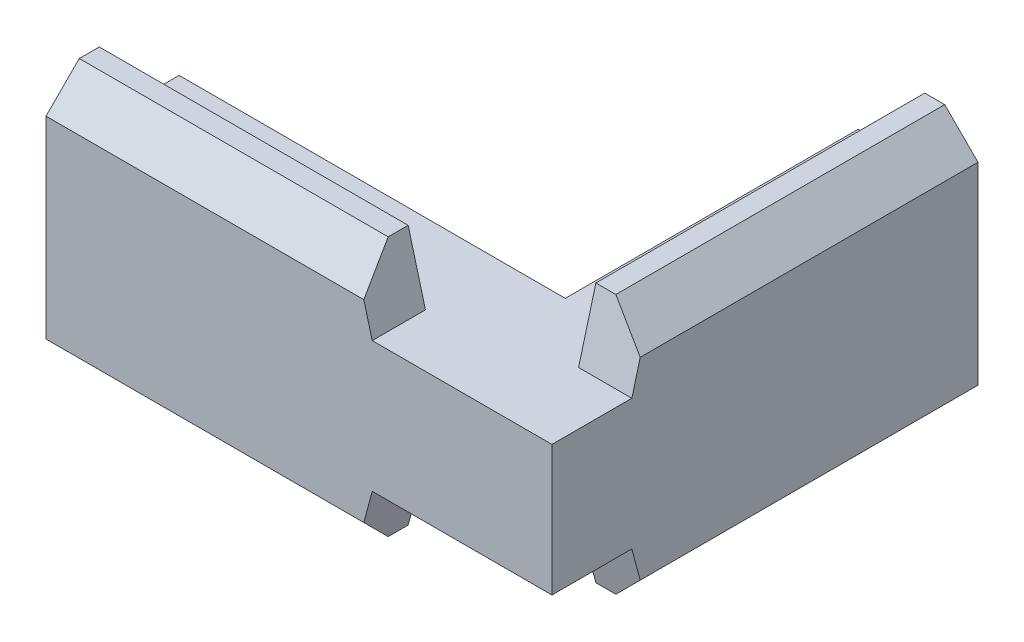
ISO-10303-21;
HEADER;
FILE_DESCRIPTION(('STEP AP214'),'2;1');
FILE_NAME('part.step','',(''),(''),'','','');
FILE_SCHEMA(('AUTOMOTIVE_DESIGN { 1 0 10303 214 1 1 1 1 }'));
ENDSEC;
DATA;
#1=APPLICATION_CONTEXT('core data for automotive mechanical design processes');
#2=APPLICATION_PROTOCOL_DEFINITION('international standard','automotive_design',2000,#1);
#3=PRODUCT_CONTEXT('',#1,'mechanical');
#4=PRODUCT('Part','Part','',(#3));
#5=PRODUCT_RELATED_PRODUCT_CATEGORY('part','',(#4));
#6=PRODUCT_DEFINITION_FORMATION('','',#4);
#7=PRODUCT_DEFINITION_CONTEXT('part definition',#1,'design');
#8=PRODUCT_DEFINITION('design','',#6,#7);
#9=PRODUCT_DEFINITION_SHAPE('','',#8);
#10=(LENGTH_UNIT() NAMED_UNIT(*) SI_UNIT(.MILLI.,.METRE.));
#11=(NAMED_UNIT(*) PLANE_ANGLE_UNIT() SI_UNIT($,.RADIAN.));
#12=(NAMED_UNIT(*) SI_UNIT($,.STERADIAN.) SOLID_ANGLE_UNIT());
#13=UNCERTAINTY_MEASURE_WITH_UNIT(LENGTH_MEASURE(1.E-05),#10,'distance_accuracy_value','');
#14=(GEOMETRIC_REPRESENTATION_CONTEXT(3) GLOBAL_UNCERTAINTY_ASSIGNED_CONTEXT((#13)) GLOBAL_UNIT_ASSIGNED_CONTEXT((#10,
#11,#12)) REPRESENTATION_CONTEXT('',''));
#15=CARTESIAN_POINT('',(0.,0.,0.));
#16=DIRECTION('',(0.,0.,1.));
#17=DIRECTION('',(1.,0.,0.));
#18=AXIS2_PLACEMENT_3D('',#15,#16,#17);
#19=CARTESIAN_POINT('',(10.,-9.75,2.700446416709));
#20=DIRECTION('',(0.,-1.,0.));
#21=DIRECTION('',(0.,0.,-1.));
#22=AXIS2_PLACEMENT_3D('',#19,#20,#21);
#23=PLANE('',#22);
#24=DIRECTION('',(0.,0.,-1.));
#25=VECTOR('',#24,1.);
#26=CARTESIAN_POINT('',(6.,-9.75,0.));
#27=LINE('',#26,#25);
#28=CARTESIAN_POINT('',(6.,-9.75000000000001,2.70044641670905));
#29=VERTEX_POINT('',#28);
#30=CARTESIAN_POINT('',(6.,-9.75,-22.));
#31=VERTEX_POINT('',#30);
#32=EDGE_CURVE('E181',#29,#31,#27,.T.);
#33=ORIENTED_EDGE('',*,*,#32,.T.);
#34=DIRECTION('',(1.,0.,0.));
#35=VECTOR('',#34,1.);
#36=CARTESIAN_POINT('',(10.,-9.75,-22.));
#37=LINE('',#36,#35);
#38=CARTESIAN_POINT('',(7.5,-9.75,-22.));
#39=VERTEX_POINT('',#38);
#40=EDGE_CURVE('E175',#31,#39,#37,.T.);
#41=ORIENTED_EDGE('',*,*,#40,.T.);
#42=DIRECTION('',(0.,0.,1.));
#43=VECTOR('',#42,1.);
#44=CARTESIAN_POINT('',(7.5,-9.75,-9.649776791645));
#45=LINE('',#44,#43);
#46=CARTESIAN_POINT('',(7.5,-9.75000000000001,2.70044641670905));
#47=VERTEX_POINT('',#46);
#48=EDGE_CURVE('E177',#47,#39,#45,.F.);
#49=ORIENTED_EDGE('',*,*,#48,.F.);
#50=DIRECTION('',(1.,0.,0.));
#51=VECTOR('',#50,1.);
#52=CARTESIAN_POINT('',(10.,-9.75,2.700446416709));
#53=LINE('',#52,#51);
#54=EDGE_CURVE('E19',#47,#29,#53,.F.);
#55=ORIENTED_EDGE('',*,*,#54,.T.);
#56=EDGE_LOOP('',(#33,#41,#49,#55));
#57=FACE_BOUND('',#56,.T.);
#58=ADVANCED_FACE('F16',(#57),#23,.T.);
#59=CARTESIAN_POINT('',(10.,9.75,-22.));
#60=DIRECTION('',(0.,1.,0.));
#61=DIRECTION('',(0.,0.,1.));
#62=AXIS2_PLACEMENT_3D('',#59,#60,#61);
#63=PLANE('',#62);
#64=DIRECTION('',(0.,0.,-1.));
#65=VECTOR('',#64,1.);
#66=CARTESIAN_POINT('',(6.,9.75,0.));
#67=LINE('',#66,#65);
#68=CARTESIAN_POINT('',(6.,9.75,-22.));
#69=VERTEX_POINT('',#68);
#70=CARTESIAN_POINT('',(6.,9.75,2.700446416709));
#71=VERTEX_POINT('',#70);
#72=EDGE_CURVE('E203',#69,#71,#67,.F.);
#73=ORIENTED_EDGE('',*,*,#72,.T.);
#74=DIRECTION('',(1.,0.,0.));
#75=VECTOR('',#74,1.);
#76=CARTESIAN_POINT('',(10.,9.75,2.700446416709));
#77=LINE('',#76,#75);
#78=CARTESIAN_POINT('',(7.5,9.75,2.70044641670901));
#79=VERTEX_POINT('',#78);
#80=EDGE_CURVE('E215',#79,#71,#77,.F.);
#81=ORIENTED_EDGE('',*,*,#80,.F.);
#82=DIRECTION('',(0.,0.,1.));
#83=VECTOR('',#82,1.);
#84=CARTESIAN_POINT('',(7.5,9.75,-9.649776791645));
#85=LINE('',#84,#83);
#86=CARTESIAN_POINT('',(7.5,9.75,-22.));
#87=VERTEX_POINT('',#86);
#88=EDGE_CURVE('E180',#87,#79,#85,.T.);
#89=ORIENTED_EDGE('',*,*,#88,.F.);
#90=DIRECTION('',(1.,0.,0.));
#91=VECTOR('',#90,1.);
#92=CARTESIAN_POINT('',(10.,9.75,-22.));
#93=LINE('',#92,#91);
#94=EDGE_CURVE('E197',#87,#69,#93,.F.);
#95=ORIENTED_EDGE('',*,*,#94,.T.);
#96=EDGE_LOOP('',(#73,#81,#89,#95));
#97=FACE_BOUND('',#96,.T.);
#98=ADVANCED_FACE('F201',(#97),#63,.T.);
#99=CARTESIAN_POINT('',(-28.,-9.75,10.));
#100=DIRECTION('',(0.,-1.,0.));
#101=DIRECTION('',(0.,0.,-1.));
#102=AXIS2_PLACEMENT_3D('',#99,#100,#101);
#103=PLANE('',#102);
#104=DIRECTION('',(1.,0.,0.));
#105=VECTOR('',#104,1.);
#106=CARTESIAN_POINT('',(1.,-9.75,6.));
#107=LINE('',#106,#105);
#108=CARTESIAN_POINT('',(-28.,-9.75,6.));
#109=VERTEX_POINT('',#108);
#110=CARTESIAN_POINT('',(-4.799553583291,-9.75,6.));
#111=VERTEX_POINT('',#110);
#112=EDGE_CURVE('E278',#109,#111,#107,.T.);
#113=ORIENTED_EDGE('',*,*,#112,.T.);
#114=DIRECTION('',(0.,0.,-1.));
#115=VECTOR('',#114,1.);
#116=CARTESIAN_POINT('',(-4.799553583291,-9.75,10.));
#117=LINE('',#116,#115);
#118=CARTESIAN_POINT('',(-4.799553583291,-9.75,7.5));
#119=VERTEX_POINT('',#118);
#120=EDGE_CURVE('E193',#111,#119,#117,.F.);
#121=ORIENTED_EDGE('',*,*,#120,.T.);
#122=DIRECTION('',(1.,0.,0.));
#123=VECTOR('',#122,1.);
#124=CARTESIAN_POINT('',(-16.39977679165,-9.75,7.5));
#125=LINE('',#124,#123);
#126=CARTESIAN_POINT('',(-28.,-9.75,7.5));
#127=VERTEX_POINT('',#126);
#128=EDGE_CURVE('E275',#127,#119,#125,.T.);
#129=ORIENTED_EDGE('',*,*,#128,.F.);
#130=DIRECTION('',(0.,0.,-1.));
#131=VECTOR('',#130,1.);
#132=CARTESIAN_POINT('',(-28.,-9.75,10.));
#133=LINE('',#132,#131);
#134=EDGE_CURVE('E195',#127,#109,#133,.T.);
#135=ORIENTED_EDGE('',*,*,#134,.T.);
#136=EDGE_LOOP('',(#113,#121,#129,#135));
#137=FACE_BOUND('',#136,.T.);
#138=ADVANCED_FACE('F406',(#137),#103,.T.);
#139=CARTESIAN_POINT('',(6.,-4.9,0.));
#140=DIRECTION('',(1.,0.,0.));
#141=DIRECTION('',(0.,0.,-1.));
#142=AXIS2_PLACEMENT_3D('',#139,#140,#141);
#143=PLANE('',#142);
#144=DIRECTION('',(0.,1.,0.));
#145=VECTOR('',#144,1.);
#146=CARTESIAN_POINT('',(6.,-4.9,-22.));
#147=LINE('',#146,#145);
#148=CARTESIAN_POINT('',(6.,-4.9,-22.));
#149=VERTEX_POINT('',#148);
#150=EDGE_CURVE('E222',#31,#149,#147,.T.);
#151=ORIENTED_EDGE('',*,*,#150,.F.);
#152=ORIENTED_EDGE('',*,*,#32,.F.);
#153=DIRECTION('',(0.,-0.965925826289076,-0.258819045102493));
#154=VECTOR('',#153,1.);
#155=CARTESIAN_POINT('',(6.,-4.9,4.));
#156=LINE('',#155,#154);
#157=CARTESIAN_POINT('',(6.,-4.9,4.));
#158=VERTEX_POINT('',#157);
#159=EDGE_CURVE('E174',#158,#29,#156,.T.);
#160=ORIENTED_EDGE('',*,*,#159,.F.);
#161=DIRECTION('',(0.,0.,1.));
#162=VECTOR('',#161,1.);
#163=CARTESIAN_POINT('',(6.,-4.9,0.));
#164=LINE('',#163,#162);
#165=EDGE_CURVE('E264',#158,#149,#164,.F.);
#166=ORIENTED_EDGE('',*,*,#165,.T.);
#167=EDGE_LOOP('',(#151,#152,#160,#166));
#168=FACE_BOUND('',#167,.T.);
#169=ADVANCED_FACE('F404',(#168),#143,.F.);
#170=CARTESIAN_POINT('',(8.75,-8.5,-9.649776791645));
#171=DIRECTION('',(0.707106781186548,-0.707106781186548,0.));
#172=DIRECTION('',(0.707106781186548,0.707106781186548,0.));
#173=AXIS2_PLACEMENT_3D('',#170,#171,#172);
#174=PLANE('',#173);
#175=DIRECTION('',(0.694746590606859,0.694746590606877,0.186156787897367));
#176=VECTOR('',#175,1.);
#177=CARTESIAN_POINT('',(7.5,-9.75000000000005,2.70044641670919));
#178=LINE('',#177,#176);
#179=CARTESIAN_POINT('',(10.,-7.25,3.37031939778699));
#180=VERTEX_POINT('',#179);
#181=EDGE_CURVE('E171',#47,#180,#178,.T.);
#182=ORIENTED_EDGE('',*,*,#181,.F.);
#183=ORIENTED_EDGE('',*,*,#48,.T.);
#184=DIRECTION('',(-0.707106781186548,-0.707106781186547,0.));
#185=VECTOR('',#184,1.);
#186=CARTESIAN_POINT('',(10.,-7.25,-22.));
#187=LINE('',#186,#185);
#188=CARTESIAN_POINT('',(10.,-7.25,-22.));
#189=VERTEX_POINT('',#188);
#190=EDGE_CURVE('E227',#189,#39,#187,.T.);
#191=ORIENTED_EDGE('',*,*,#190,.F.);
#192=DIRECTION('',(0.,0.,-1.));
#193=VECTOR('',#192,1.);
#194=CARTESIAN_POINT('',(10.,-7.25,10.));
#195=LINE('',#194,#193);
#196=EDGE_CURVE('E185',#180,#189,#195,.T.);
#197=ORIENTED_EDGE('',*,*,#196,.F.);
#198=EDGE_LOOP('',(#182,#183,#191,#197));
#199=FACE_BOUND('',#198,.T.);
#200=ADVANCED_FACE('F183',(#199),#174,.T.);
#201=CARTESIAN_POINT('',(8.75,8.5,-9.649776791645));
#202=DIRECTION('',(0.707106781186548,0.707106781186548,0.));
#203=DIRECTION('',(-0.707106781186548,0.707106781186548,0.));
#204=AXIS2_PLACEMENT_3D('',#201,#202,#203);
#205=PLANE('',#204);
#206=DIRECTION('',(0.707106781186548,-0.707106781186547,0.));
#207=VECTOR('',#206,1.);
#208=CARTESIAN_POINT('',(7.5,9.75,-22.));
#209=LINE('',#208,#207);
#210=CARTESIAN_POINT('',(10.,7.25,-22.));
#211=VERTEX_POINT('',#210);
#212=EDGE_CURVE('E221',#87,#211,#209,.T.);
#213=ORIENTED_EDGE('',*,*,#212,.F.);
#214=ORIENTED_EDGE('',*,*,#88,.T.);
#215=DIRECTION('',(-0.694746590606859,0.694746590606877,-0.186156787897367));
#216=VECTOR('',#215,1.);
#217=CARTESIAN_POINT('',(10.,7.24999999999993,3.37031939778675));
#218=LINE('',#217,#216);
#219=CARTESIAN_POINT('',(10.,7.24999999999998,3.37031939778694));
#220=VERTEX_POINT('',#219);
#221=EDGE_CURVE('E187',#220,#79,#218,.T.);
#222=ORIENTED_EDGE('',*,*,#221,.F.);
#223=DIRECTION('',(0.,0.,-1.));
#224=VECTOR('',#223,1.);
#225=CARTESIAN_POINT('',(10.,7.25,10.));
#226=LINE('',#225,#224);
#227=EDGE_CURVE('E243',#211,#220,#226,.F.);
#228=ORIENTED_EDGE('',*,*,#227,.F.);
#229=EDGE_LOOP('',(#213,#214,#222,#228));
#230=FACE_BOUND('',#229,.T.);
#231=ADVANCED_FACE('F242',(#230),#205,.T.);
#232=CARTESIAN_POINT('',(10.,-4.9,4.));
#233=DIRECTION('',(0.,-0.258819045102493,0.965925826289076));
#234=DIRECTION('',(0.,-0.965925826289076,-0.258819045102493));
#235=AXIS2_PLACEMENT_3D('',#232,#233,#234);
#236=PLANE('',#235);
#237=ORIENTED_EDGE('',*,*,#159,.T.);
#238=ORIENTED_EDGE('',*,*,#54,.F.);
#239=ORIENTED_EDGE('',*,*,#181,.T.);
#240=DIRECTION('',(0.,-0.965925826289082,-0.258819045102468));
#241=VECTOR('',#240,1.);
#242=CARTESIAN_POINT('',(10.,-4.9,4.));
#243=LINE('',#242,#241);
#244=CARTESIAN_POINT('',(10.,-4.9,4.));
#245=VERTEX_POINT('',#244);
#246=EDGE_CURVE('E251',#245,#180,#243,.T.);
#247=ORIENTED_EDGE('',*,*,#246,.F.);
#248=DIRECTION('',(1.,0.,0.));
#249=VECTOR('',#248,1.);
#250=CARTESIAN_POINT('',(1.,-4.9,4.));
#251=LINE('',#250,#249);
#252=EDGE_CURVE('E266',#245,#158,#251,.F.);
#253=ORIENTED_EDGE('',*,*,#252,.T.);
#254=EDGE_LOOP('',(#237,#238,#239,#247,#253));
#255=FACE_BOUND('',#254,.T.);
#256=ADVANCED_FACE('F168',(#255),#236,.T.);
#257=CARTESIAN_POINT('',(10.,9.75,2.700446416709));
#258=DIRECTION('',(0.,0.258819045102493,0.965925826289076));
#259=DIRECTION('',(0.,-0.965925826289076,0.258819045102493));
#260=AXIS2_PLACEMENT_3D('',#257,#258,#259);
#261=PLANE('',#260);
#262=DIRECTION('',(1.,0.,0.));
#263=VECTOR('',#262,1.);
#264=CARTESIAN_POINT('',(1.,4.9,4.));
#265=LINE('',#264,#263);
#266=CARTESIAN_POINT('',(10.,4.89999999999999,3.99999999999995));
#267=VERTEX_POINT('',#266);
#268=CARTESIAN_POINT('',(6.,4.89999999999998,3.9999999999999));
#269=VERTEX_POINT('',#268);
#270=EDGE_CURVE('E322',#267,#269,#265,.F.);
#271=ORIENTED_EDGE('',*,*,#270,.F.);
#272=DIRECTION('',(0.,-0.965925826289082,0.258819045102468));
#273=VECTOR('',#272,1.);
#274=CARTESIAN_POINT('',(10.,7.25,3.370319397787));
#275=LINE('',#274,#273);
#276=EDGE_CURVE('E238',#220,#267,#275,.T.);
#277=ORIENTED_EDGE('',*,*,#276,.F.);
#278=ORIENTED_EDGE('',*,*,#221,.T.);
#279=ORIENTED_EDGE('',*,*,#80,.T.);
#280=DIRECTION('',(0.,-0.965925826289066,0.258819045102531));
#281=VECTOR('',#280,1.);
#282=CARTESIAN_POINT('',(6.,9.75,2.700446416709));
#283=LINE('',#282,#281);
#284=EDGE_CURVE('E214',#71,#269,#283,.T.);
#285=ORIENTED_EDGE('',*,*,#284,.T.);
#286=EDGE_LOOP('',(#271,#277,#278,#279,#285));
#287=FACE_BOUND('',#286,.T.);
#288=ADVANCED_FACE('F237',(#287),#261,.T.);
#289=CARTESIAN_POINT('',(6.,-4.9,0.));
#290=DIRECTION('',(1.,0.,0.));
#291=DIRECTION('',(0.,0.,-1.));
#292=AXIS2_PLACEMENT_3D('',#289,#290,#291);
#293=PLANE('',#292);
#294=ORIENTED_EDGE('',*,*,#284,.F.);
#295=ORIENTED_EDGE('',*,*,#72,.F.);
#296=DIRECTION('',(0.,1.,0.));
#297=VECTOR('',#296,1.);
#298=CARTESIAN_POINT('',(6.,-4.9,-22.));
#299=LINE('',#298,#297);
#300=CARTESIAN_POINT('',(6.,4.9,-22.));
#301=VERTEX_POINT('',#300);
#302=EDGE_CURVE('E212',#301,#69,#299,.T.);
#303=ORIENTED_EDGE('',*,*,#302,.F.);
#304=DIRECTION('',(0.,0.,1.));
#305=VECTOR('',#304,1.);
#306=CARTESIAN_POINT('',(6.,4.9,0.));
#307=LINE('',#306,#305);
#308=EDGE_CURVE('E317',#269,#301,#307,.F.);
#309=ORIENTED_EDGE('',*,*,#308,.F.);
#310=EDGE_LOOP('',(#294,#295,#303,#309));
#311=FACE_BOUND('',#310,.T.);
#312=ADVANCED_FACE('F210',(#311),#293,.F.);
#313=CARTESIAN_POINT('',(10.,-4.9,-22.));
#314=DIRECTION('',(0.,0.,-1.));
#315=DIRECTION('',(-1.,0.,0.));
#316=AXIS2_PLACEMENT_3D('',#313,#314,#315);
#317=PLANE('',#316);
#318=ORIENTED_EDGE('',*,*,#212,.T.);
#319=DIRECTION('',(0.,1.,0.));
#320=VECTOR('',#319,1.);
#321=CARTESIAN_POINT('',(10.,-4.9,-22.));
#322=LINE('',#321,#320);
#323=EDGE_CURVE('E246',#189,#211,#322,.T.);
#324=ORIENTED_EDGE('',*,*,#323,.F.);
#325=ORIENTED_EDGE('',*,*,#190,.T.);
#326=ORIENTED_EDGE('',*,*,#40,.F.);
#327=ORIENTED_EDGE('',*,*,#150,.T.);
#328=DIRECTION('',(1.,0.,0.));
#329=VECTOR('',#328,1.);
#330=CARTESIAN_POINT('',(1.,-4.9,-22.));
#331=LINE('',#330,#329);
#332=CARTESIAN_POINT('',(1.,-4.9,-22.));
#333=VERTEX_POINT('',#332);
#334=EDGE_CURVE('E262',#149,#333,#331,.F.);
#335=ORIENTED_EDGE('',*,*,#334,.T.);
#336=DIRECTION('',(0.,1.,0.));
#337=VECTOR('',#336,1.);
#338=CARTESIAN_POINT('',(1.,-4.9,-22.));
#339=LINE('',#338,#337);
#340=CARTESIAN_POINT('',(1.,4.9,-22.));
#341=VERTEX_POINT('',#340);
#342=EDGE_CURVE('E224',#341,#333,#339,.F.);
#343=ORIENTED_EDGE('',*,*,#342,.F.);
#344=DIRECTION('',(1.,0.,0.));
#345=VECTOR('',#344,1.);
#346=CARTESIAN_POINT('',(1.,4.9,-22.));
#347=LINE('',#346,#345);
#348=EDGE_CURVE('E219',#301,#341,#347,.F.);
#349=ORIENTED_EDGE('',*,*,#348,.F.);
#350=ORIENTED_EDGE('',*,*,#302,.T.);
#351=ORIENTED_EDGE('',*,*,#94,.F.);
#352=EDGE_LOOP('',(#318,#324,#325,#326,#327,#335,#343,#349,#350,#351));
#353=FACE_BOUND('',#352,.T.);
#354=ADVANCED_FACE('F217',(#353),#317,.T.);
#355=CARTESIAN_POINT('',(1.,-4.9,-22.));
#356=DIRECTION('',(-1.,0.,0.));
#357=DIRECTION('',(0.,0.,1.));
#358=AXIS2_PLACEMENT_3D('',#355,#356,#357);
#359=PLANE('',#358);
#360=DIRECTION('',(0.,0.,1.));
#361=VECTOR('',#360,1.);
#362=CARTESIAN_POINT('',(1.,4.9,0.));
#363=LINE('',#362,#361);
#364=CARTESIAN_POINT('',(1.,4.9,0.));
#365=VERTEX_POINT('',#364);
#366=EDGE_CURVE('E294',#341,#365,#363,.T.);
#367=ORIENTED_EDGE('',*,*,#366,.F.);
#368=ORIENTED_EDGE('',*,*,#342,.T.);
#369=DIRECTION('',(0.,0.,1.));
#370=VECTOR('',#369,1.);
#371=CARTESIAN_POINT('',(1.,-4.9,0.));
#372=LINE('',#371,#370);
#373=CARTESIAN_POINT('',(1.,-4.9,0.));
#374=VERTEX_POINT('',#373);
#375=EDGE_CURVE('E260',#333,#374,#372,.T.);
#376=ORIENTED_EDGE('',*,*,#375,.T.);
#377=DIRECTION('',(0.,1.,0.));
#378=VECTOR('',#377,1.);
#379=CARTESIAN_POINT('',(1.,-4.9,0.));
#380=LINE('',#379,#378);
#381=EDGE_CURVE('E281',#365,#374,#380,.F.);
#382=ORIENTED_EDGE('',*,*,#381,.F.);
#383=EDGE_LOOP('',(#367,#368,#376,#382));
#384=FACE_BOUND('',#383,.T.);
#385=ADVANCED_FACE('F292',(#384),#359,.T.);
#386=CARTESIAN_POINT('',(-4.799553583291,9.75,10.));
#387=DIRECTION('',(0.,1.,0.));
#388=DIRECTION('',(0.,0.,1.));
#389=AXIS2_PLACEMENT_3D('',#386,#387,#388);
#390=PLANE('',#389);
#391=DIRECTION('',(1.,0.,0.));
#392=VECTOR('',#391,1.);
#393=CARTESIAN_POINT('',(1.,9.75,6.));
#394=LINE('',#393,#392);
#395=CARTESIAN_POINT('',(-4.79955358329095,9.75000000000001,6.));
#396=VERTEX_POINT('',#395);
#397=CARTESIAN_POINT('',(-28.,9.75,6.));
#398=VERTEX_POINT('',#397);
#399=EDGE_CURVE('E284',#396,#398,#394,.F.);
#400=ORIENTED_EDGE('',*,*,#399,.T.);
#401=DIRECTION('',(0.,0.,1.));
#402=VECTOR('',#401,1.);
#403=CARTESIAN_POINT('',(-28.,9.75,10.));
#404=LINE('',#403,#402);
#405=CARTESIAN_POINT('',(-28.,9.75,7.5));
#406=VERTEX_POINT('',#405);
#407=EDGE_CURVE('E287',#398,#406,#404,.T.);
#408=ORIENTED_EDGE('',*,*,#407,.T.);
#409=DIRECTION('',(1.,0.,0.));
#410=VECTOR('',#409,1.);
#411=CARTESIAN_POINT('',(-16.39977679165,9.75,7.5));
#412=LINE('',#411,#410);
#413=CARTESIAN_POINT('',(-4.7995535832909,9.75000000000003,7.5));
#414=VERTEX_POINT('',#413);
#415=EDGE_CURVE('E374',#414,#406,#412,.F.);
#416=ORIENTED_EDGE('',*,*,#415,.F.);
#417=DIRECTION('',(0.,0.,1.));
#418=VECTOR('',#417,1.);
#419=CARTESIAN_POINT('',(-4.79955358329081,9.75000000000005,10.));
#420=LINE('',#419,#418);
#421=EDGE_CURVE('E379',#396,#414,#420,.T.);
#422=ORIENTED_EDGE('',*,*,#421,.F.);
#423=EDGE_LOOP('',(#400,#408,#416,#422));
#424=FACE_BOUND('',#423,.T.);
#425=ADVANCED_FACE('F446',(#424),#390,.T.);
#426=CARTESIAN_POINT('',(1.,-4.9,6.));
#427=DIRECTION('',(0.,0.,1.));
#428=DIRECTION('',(1.,0.,0.));
#429=AXIS2_PLACEMENT_3D('',#426,#427,#428);
#430=PLANE('',#429);
#431=DIRECTION('',(0.,1.,0.));
#432=VECTOR('',#431,1.);
#433=CARTESIAN_POINT('',(-28.,-4.9,6.));
#434=LINE('',#433,#432);
#435=CARTESIAN_POINT('',(-28.,4.9,6.));
#436=VERTEX_POINT('',#435);
#437=EDGE_CURVE('E367',#398,#436,#434,.F.);
#438=ORIENTED_EDGE('',*,*,#437,.F.);
#439=ORIENTED_EDGE('',*,*,#399,.F.);
#440=DIRECTION('',(-0.258819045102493,0.965925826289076,0.));
#441=VECTOR('',#440,1.);
#442=CARTESIAN_POINT('',(-3.5,4.9,6.));
#443=LINE('',#442,#441);
#444=CARTESIAN_POINT('',(-3.5,4.9,6.));
#445=VERTEX_POINT('',#444);
#446=EDGE_CURVE('E381',#445,#396,#443,.T.);
#447=ORIENTED_EDGE('',*,*,#446,.F.);
#448=DIRECTION('',(1.,0.,0.));
#449=VECTOR('',#448,1.);
#450=CARTESIAN_POINT('',(1.,4.9,6.));
#451=LINE('',#450,#449);
#452=EDGE_CURVE('E328',#436,#445,#451,.T.);
#453=ORIENTED_EDGE('',*,*,#452,.F.);
#454=EDGE_LOOP('',(#438,#439,#447,#453));
#455=FACE_BOUND('',#454,.T.);
#456=ADVANCED_FACE('F443',(#455),#430,.F.);
#457=CARTESIAN_POINT('',(1.,-4.9,0.));
#458=DIRECTION('',(0.,0.,-1.));
#459=DIRECTION('',(-1.,0.,0.));
#460=AXIS2_PLACEMENT_3D('',#457,#458,#459);
#461=PLANE('',#460);
#462=DIRECTION('',(1.,0.,0.));
#463=VECTOR('',#462,1.);
#464=CARTESIAN_POINT('',(1.,4.9,0.));
#465=LINE('',#464,#463);
#466=CARTESIAN_POINT('',(-28.,4.9,0.));
#467=VERTEX_POINT('',#466);
#468=EDGE_CURVE('E310',#365,#467,#465,.F.);
#469=ORIENTED_EDGE('',*,*,#468,.F.);
#470=ORIENTED_EDGE('',*,*,#381,.T.);
#471=DIRECTION('',(1.,0.,0.));
#472=VECTOR('',#471,1.);
#473=CARTESIAN_POINT('',(1.,-4.9,0.));
#474=LINE('',#473,#472);
#475=CARTESIAN_POINT('',(-28.,-4.9,0.));
#476=VERTEX_POINT('',#475);
#477=EDGE_CURVE('E255',#374,#476,#474,.F.);
#478=ORIENTED_EDGE('',*,*,#477,.T.);
#479=DIRECTION('',(0.,1.,0.));
#480=VECTOR('',#479,1.);
#481=CARTESIAN_POINT('',(-28.,-4.9,0.));
#482=LINE('',#481,#480);
#483=EDGE_CURVE('E308',#467,#476,#482,.F.);
#484=ORIENTED_EDGE('',*,*,#483,.F.);
#485=EDGE_LOOP('',(#469,#470,#478,#484));
#486=FACE_BOUND('',#485,.T.);
#487=ADVANCED_FACE('F307',(#486),#461,.T.);
#488=CARTESIAN_POINT('',(1.,-4.9,6.));
#489=DIRECTION('',(0.,0.,1.));
#490=DIRECTION('',(1.,0.,0.));
#491=AXIS2_PLACEMENT_3D('',#488,#489,#490);
#492=PLANE('',#491);
#493=DIRECTION('',(0.258819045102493,0.965925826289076,0.));
#494=VECTOR('',#493,1.);
#495=CARTESIAN_POINT('',(-4.799553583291,-9.75,6.));
#496=LINE('',#495,#494);
#497=CARTESIAN_POINT('',(-3.5000000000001,-4.89999999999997,6.));
#498=VERTEX_POINT('',#497);
#499=EDGE_CURVE('E270',#111,#498,#496,.T.);
#500=ORIENTED_EDGE('',*,*,#499,.F.);
#501=ORIENTED_EDGE('',*,*,#112,.F.);
#502=DIRECTION('',(0.,1.,0.));
#503=VECTOR('',#502,1.);
#504=CARTESIAN_POINT('',(-28.,-4.9,6.));
#505=LINE('',#504,#503);
#506=CARTESIAN_POINT('',(-28.,-4.9,6.));
#507=VERTEX_POINT('',#506);
#508=EDGE_CURVE('E360',#507,#109,#505,.F.);
#509=ORIENTED_EDGE('',*,*,#508,.F.);
#510=DIRECTION('',(1.,0.,0.));
#511=VECTOR('',#510,1.);
#512=CARTESIAN_POINT('',(1.,-4.9,6.));
#513=LINE('',#512,#511);
#514=EDGE_CURVE('E252',#507,#498,#513,.T.);
#515=ORIENTED_EDGE('',*,*,#514,.T.);
#516=EDGE_LOOP('',(#500,#501,#509,#515));
#517=FACE_BOUND('',#516,.T.);
#518=ADVANCED_FACE('F437',(#517),#492,.F.);
#519=CARTESIAN_POINT('',(-16.39977679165,-8.5,8.75));
#520=DIRECTION('',(0.,-0.707106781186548,0.707106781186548));
#521=DIRECTION('',(0.,-0.707106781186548,-0.707106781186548));
#522=AXIS2_PLACEMENT_3D('',#519,#520,#521);
#523=PLANE('',#522);
#524=DIRECTION('',(0.,0.707106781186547,0.707106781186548));
#525=VECTOR('',#524,1.);
#526=CARTESIAN_POINT('',(-28.,-9.75,7.5));
#527=LINE('',#526,#525);
#528=CARTESIAN_POINT('',(-28.,-7.25,10.));
#529=VERTEX_POINT('',#528);
#530=EDGE_CURVE('E371',#127,#529,#527,.T.);
#531=ORIENTED_EDGE('',*,*,#530,.F.);
#532=ORIENTED_EDGE('',*,*,#128,.T.);
#533=DIRECTION('',(-0.186156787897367,-0.694746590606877,-0.694746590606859));
#534=VECTOR('',#533,1.);
#535=CARTESIAN_POINT('',(-4.12968060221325,-7.24999999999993,10.));
#536=LINE('',#535,#534);
#537=CARTESIAN_POINT('',(-4.12968060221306,-7.24999999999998,10.));
#538=VERTEX_POINT('',#537);
#539=EDGE_CURVE('E272',#538,#119,#536,.T.);
#540=ORIENTED_EDGE('',*,*,#539,.F.);
#541=DIRECTION('',(1.,0.,0.));
#542=VECTOR('',#541,1.);
#543=CARTESIAN_POINT('',(-28.,-7.25,10.));
#544=LINE('',#543,#542);
#545=EDGE_CURVE('E357',#529,#538,#544,.T.);
#546=ORIENTED_EDGE('',*,*,#545,.F.);
#547=EDGE_LOOP('',(#531,#532,#540,#546));
#548=FACE_BOUND('',#547,.T.);
#549=ADVANCED_FACE('F396',(#548),#523,.T.);
#550=CARTESIAN_POINT('',(-4.799553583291,-9.75,10.));
#551=DIRECTION('',(0.965925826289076,-0.258819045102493,0.));
#552=DIRECTION('',(0.258819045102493,0.965925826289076,0.));
#553=AXIS2_PLACEMENT_3D('',#550,#551,#552);
#554=PLANE('',#553);
#555=DIRECTION('',(0.,0.,1.));
#556=VECTOR('',#555,1.);
#557=CARTESIAN_POINT('',(-3.5,-4.9,0.));
#558=LINE('',#557,#556);
#559=CARTESIAN_POINT('',(-3.5000000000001,-4.89999999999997,10.));
#560=VERTEX_POINT('',#559);
#561=EDGE_CURVE('E268',#498,#560,#558,.T.);
#562=ORIENTED_EDGE('',*,*,#561,.T.);
#563=DIRECTION('',(0.258819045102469,0.965925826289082,0.));
#564=VECTOR('',#563,1.);
#565=CARTESIAN_POINT('',(-4.129680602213,-7.25,10.));
#566=LINE('',#565,#564);
#567=EDGE_CURVE('E352',#538,#560,#566,.T.);
#568=ORIENTED_EDGE('',*,*,#567,.F.);
#569=ORIENTED_EDGE('',*,*,#539,.T.);
#570=ORIENTED_EDGE('',*,*,#120,.F.);
#571=ORIENTED_EDGE('',*,*,#499,.T.);
#572=EDGE_LOOP('',(#562,#568,#569,#570,#571));
#573=FACE_BOUND('',#572,.T.);
#574=ADVANCED_FACE('F399',(#573),#554,.T.);
#575=CARTESIAN_POINT('',(1.,-4.9,0.));
#576=DIRECTION('',(0.,1.,0.));
#577=DIRECTION('',(0.,0.,1.));
#578=AXIS2_PLACEMENT_3D('',#575,#576,#577);
#579=PLANE('',#578);
#580=DIRECTION('',(0.,0.,1.));
#581=VECTOR('',#580,1.);
#582=CARTESIAN_POINT('',(-28.,-4.9,0.));
#583=LINE('',#582,#581);
#584=EDGE_CURVE('E302',#476,#507,#583,.T.);
#585=ORIENTED_EDGE('',*,*,#584,.F.);
#586=ORIENTED_EDGE('',*,*,#477,.F.);
#587=ORIENTED_EDGE('',*,*,#375,.F.);
#588=ORIENTED_EDGE('',*,*,#334,.F.);
#589=ORIENTED_EDGE('',*,*,#165,.F.);
#590=ORIENTED_EDGE('',*,*,#252,.F.);
#591=DIRECTION('',(0.,0.,-1.));
#592=VECTOR('',#591,1.);
#593=CARTESIAN_POINT('',(10.,-4.9,10.));
#594=LINE('',#593,#592);
#595=CARTESIAN_POINT('',(10.,-4.9,10.));
#596=VERTEX_POINT('',#595);
#597=EDGE_CURVE('E331',#596,#245,#594,.T.);
#598=ORIENTED_EDGE('',*,*,#597,.F.);
#599=DIRECTION('',(1.,0.,0.));
#600=VECTOR('',#599,1.);
#601=CARTESIAN_POINT('',(-28.,-4.9,10.));
#602=LINE('',#601,#600);
#603=EDGE_CURVE('E350',#560,#596,#602,.T.);
#604=ORIENTED_EDGE('',*,*,#603,.F.);
#605=ORIENTED_EDGE('',*,*,#561,.F.);
#606=ORIENTED_EDGE('',*,*,#514,.F.);
#607=EDGE_LOOP('',(#585,#586,#587,#588,#589,#590,#598,#604,#605,#606));
#608=FACE_BOUND('',#607,.T.);
#609=ADVANCED_FACE('F299',(#608),#579,.F.);
#610=CARTESIAN_POINT('',(10.,-4.9,10.));
#611=DIRECTION('',(1.,0.,0.));
#612=DIRECTION('',(0.,0.,-1.));
#613=AXIS2_PLACEMENT_3D('',#610,#611,#612);
#614=PLANE('',#613);
#615=ORIENTED_EDGE('',*,*,#597,.T.);
#616=ORIENTED_EDGE('',*,*,#246,.T.);
#617=ORIENTED_EDGE('',*,*,#196,.T.);
#618=ORIENTED_EDGE('',*,*,#323,.T.);
#619=ORIENTED_EDGE('',*,*,#227,.T.);
#620=ORIENTED_EDGE('',*,*,#276,.T.);
#621=DIRECTION('',(0.,0.,1.));
#622=VECTOR('',#621,1.);
#623=CARTESIAN_POINT('',(10.,4.9,0.));
#624=LINE('',#623,#622);
#625=CARTESIAN_POINT('',(10.,4.9,10.));
#626=VERTEX_POINT('',#625);
#627=EDGE_CURVE('E325',#626,#267,#624,.F.);
#628=ORIENTED_EDGE('',*,*,#627,.F.);
#629=DIRECTION('',(0.,1.,0.));
#630=VECTOR('',#629,1.);
#631=CARTESIAN_POINT('',(10.,-4.9,10.));
#632=LINE('',#631,#630);
#633=EDGE_CURVE('E343',#596,#626,#632,.T.);
#634=ORIENTED_EDGE('',*,*,#633,.F.);
#635=EDGE_LOOP('',(#615,#616,#617,#618,#619,#620,#628,#634));
#636=FACE_BOUND('',#635,.T.);
#637=ADVANCED_FACE('F250',(#636),#614,.T.);
#638=CARTESIAN_POINT('',(1.,4.9,0.));
#639=DIRECTION('',(0.,1.,0.));
#640=DIRECTION('',(0.,0.,1.));
#641=AXIS2_PLACEMENT_3D('',#638,#639,#640);
#642=PLANE('',#641);
#643=ORIENTED_EDGE('',*,*,#468,.T.);
#644=DIRECTION('',(0.,0.,1.));
#645=VECTOR('',#644,1.);
#646=CARTESIAN_POINT('',(-28.,4.9,0.));
#647=LINE('',#646,#645);
#648=EDGE_CURVE('E365',#436,#467,#647,.F.);
#649=ORIENTED_EDGE('',*,*,#648,.F.);
#650=ORIENTED_EDGE('',*,*,#452,.T.);
#651=DIRECTION('',(0.,0.,1.));
#652=VECTOR('',#651,1.);
#653=CARTESIAN_POINT('',(-3.5,4.9,10.));
#654=LINE('',#653,#652);
#655=CARTESIAN_POINT('',(-3.5,4.9,10.));
#656=VERTEX_POINT('',#655);
#657=EDGE_CURVE('E313',#656,#445,#654,.F.);
#658=ORIENTED_EDGE('',*,*,#657,.F.);
#659=DIRECTION('',(1.,0.,0.));
#660=VECTOR('',#659,1.);
#661=CARTESIAN_POINT('',(-28.,4.9,10.));
#662=LINE('',#661,#660);
#663=EDGE_CURVE('E336',#626,#656,#662,.F.);
#664=ORIENTED_EDGE('',*,*,#663,.F.);
#665=ORIENTED_EDGE('',*,*,#627,.T.);
#666=ORIENTED_EDGE('',*,*,#270,.T.);
#667=ORIENTED_EDGE('',*,*,#308,.T.);
#668=ORIENTED_EDGE('',*,*,#348,.T.);
#669=ORIENTED_EDGE('',*,*,#366,.T.);
#670=EDGE_LOOP('',(#643,#649,#650,#658,#664,#665,#666,#667,#668,#669));
#671=FACE_BOUND('',#670,.T.);
#672=ADVANCED_FACE('F315',(#671),#642,.T.);
#673=CARTESIAN_POINT('',(-3.5,4.9,10.));
#674=DIRECTION('',(0.965925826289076,0.258819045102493,0.));
#675=DIRECTION('',(-0.258819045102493,0.965925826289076,0.));
#676=AXIS2_PLACEMENT_3D('',#673,#674,#675);
#677=PLANE('',#676);
#678=ORIENTED_EDGE('',*,*,#446,.T.);
#679=ORIENTED_EDGE('',*,*,#421,.T.);
#680=DIRECTION('',(-0.186156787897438,0.694746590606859,-0.694746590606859));
#681=VECTOR('',#680,1.);
#682=CARTESIAN_POINT('',(-4.12968060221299,7.25,10.));
#683=LINE('',#682,#681);
#684=CARTESIAN_POINT('',(-4.12968060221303,7.24999999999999,10.));
#685=VERTEX_POINT('',#684);
#686=EDGE_CURVE('E376',#685,#414,#683,.T.);
#687=ORIENTED_EDGE('',*,*,#686,.F.);
#688=DIRECTION('',(-0.258819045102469,0.965925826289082,0.));
#689=VECTOR('',#688,1.);
#690=CARTESIAN_POINT('',(-3.5,4.9,10.));
#691=LINE('',#690,#689);
#692=EDGE_CURVE('E342',#656,#685,#691,.T.);
#693=ORIENTED_EDGE('',*,*,#692,.F.);
#694=ORIENTED_EDGE('',*,*,#657,.T.);
#695=EDGE_LOOP('',(#678,#679,#687,#693,#694));
#696=FACE_BOUND('',#695,.T.);
#697=ADVANCED_FACE('F384',(#696),#677,.T.);
#698=CARTESIAN_POINT('',(-16.39977679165,8.5,8.75));
#699=DIRECTION('',(0.,0.707106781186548,0.707106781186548));
#700=DIRECTION('',(0.,-0.707106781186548,0.707106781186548));
#701=AXIS2_PLACEMENT_3D('',#698,#699,#700);
#702=PLANE('',#701);
#703=ORIENTED_EDGE('',*,*,#686,.T.);
#704=ORIENTED_EDGE('',*,*,#415,.T.);
#705=DIRECTION('',(0.,0.707106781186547,-0.707106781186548));
#706=VECTOR('',#705,1.);
#707=CARTESIAN_POINT('',(-28.,7.25,10.));
#708=LINE('',#707,#706);
#709=CARTESIAN_POINT('',(-28.,7.25,10.));
#710=VERTEX_POINT('',#709);
#711=EDGE_CURVE('E34',#710,#406,#708,.T.);
#712=ORIENTED_EDGE('',*,*,#711,.F.);
#713=DIRECTION('',(1.,0.,0.));
#714=VECTOR('',#713,1.);
#715=CARTESIAN_POINT('',(-28.,7.25,10.));
#716=LINE('',#715,#714);
#717=EDGE_CURVE('E25',#685,#710,#716,.F.);
#718=ORIENTED_EDGE('',*,*,#717,.F.);
#719=EDGE_LOOP('',(#703,#704,#712,#718));
#720=FACE_BOUND('',#719,.T.);
#721=ADVANCED_FACE('F387',(#720),#702,.T.);
#722=CARTESIAN_POINT('',(-28.,-4.9,0.));
#723=DIRECTION('',(-1.,0.,0.));
#724=DIRECTION('',(0.,0.,1.));
#725=AXIS2_PLACEMENT_3D('',#722,#723,#724);
#726=PLANE('',#725);
#727=ORIENTED_EDGE('',*,*,#508,.T.);
#728=ORIENTED_EDGE('',*,*,#134,.F.);
#729=ORIENTED_EDGE('',*,*,#530,.T.);
#730=DIRECTION('',(0.,1.,0.));
#731=VECTOR('',#730,1.);
#732=CARTESIAN_POINT('',(-28.,-4.9,10.));
#733=LINE('',#732,#731);
#734=EDGE_CURVE('E10',#710,#529,#733,.F.);
#735=ORIENTED_EDGE('',*,*,#734,.F.);
#736=ORIENTED_EDGE('',*,*,#711,.T.);
#737=ORIENTED_EDGE('',*,*,#407,.F.);
#738=ORIENTED_EDGE('',*,*,#437,.T.);
#739=ORIENTED_EDGE('',*,*,#648,.T.);
#740=ORIENTED_EDGE('',*,*,#483,.T.);
#741=ORIENTED_EDGE('',*,*,#584,.T.);
#742=EDGE_LOOP('',(#727,#728,#729,#735,#736,#737,#738,#739,#740,#741));
#743=FACE_BOUND('',#742,.T.);
#744=ADVANCED_FACE('F392',(#743),#726,.T.);
#745=CARTESIAN_POINT('',(-28.,-4.9,10.));
#746=DIRECTION('',(0.,0.,1.));
#747=DIRECTION('',(1.,0.,0.));
#748=AXIS2_PLACEMENT_3D('',#745,#746,#747);
#749=PLANE('',#748);
#750=ORIENTED_EDGE('',*,*,#717,.T.);
#751=ORIENTED_EDGE('',*,*,#734,.T.);
#752=ORIENTED_EDGE('',*,*,#545,.T.);
#753=ORIENTED_EDGE('',*,*,#567,.T.);
#754=ORIENTED_EDGE('',*,*,#603,.T.);
#755=ORIENTED_EDGE('',*,*,#633,.T.);
#756=ORIENTED_EDGE('',*,*,#663,.T.);
#757=ORIENTED_EDGE('',*,*,#692,.T.);
#758=EDGE_LOOP('',(#750,#751,#752,#753,#754,#755,#756,#757));
#759=FACE_BOUND('',#758,.T.);
#760=ADVANCED_FACE('F347',(#759),#749,.T.);
#761=CLOSED_SHELL('',(#58,#98,#138,#169,#200,#231,#256,#288,#312,#354,#385,#425,#456,#487,#518,
#549,#574,#609,#637,#672,#697,#721,#744,#760));
#762=MANIFOLD_SOLID_BREP('B1',#761);
#763=ADVANCED_BREP_SHAPE_REPRESENTATION('',(#18,#762),#14);
#764=SHAPE_DEFINITION_REPRESENTATION(#9,#763);
ENDSEC;
END-ISO-10303-21;
